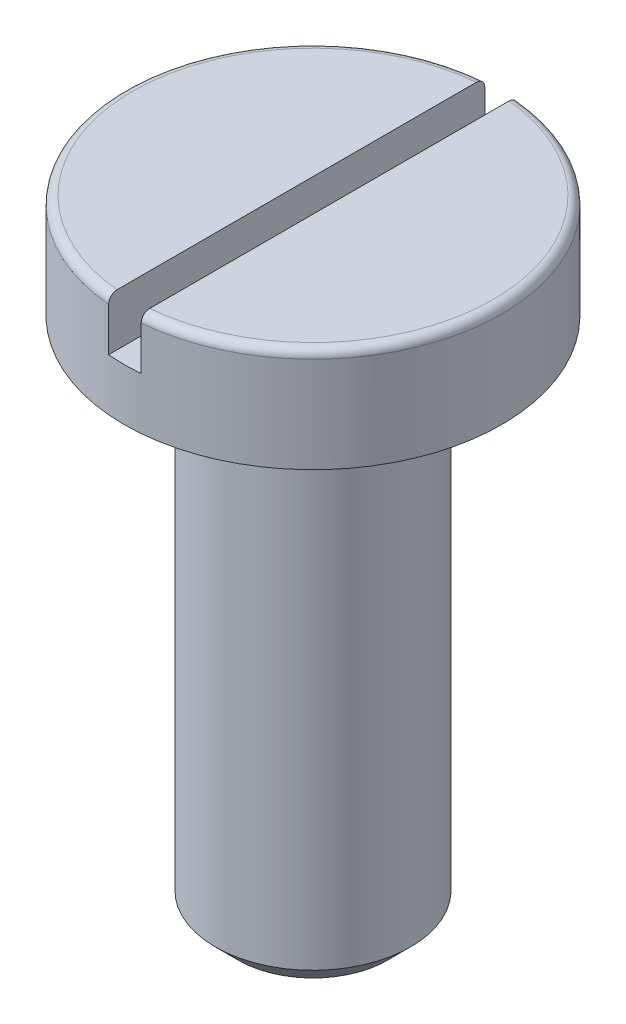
from build123d import *

# Parameters (mm, degrees)
ESQUISSE1_R             = 1.5
BASE_EXTRUSION_DEPTH    = 8
CHANFREIN1_SIZE         = 0.35
ESQUISSE3_W             = 0.5
ESQUISSE3_H             = 5.8
ENL_V_MAT_EXTRU_1_DEPTH = 0.8


with BuildPart() as part:
    # Esquisse1 → Base-Extrusion (new body)
    with BuildSketch(Plane(origin=(0, 0, 0), x_dir=(1, 0, 0), z_dir=(0, 1, 0))):
        with Locations(Location((0, 0, 0), (0, 0, 270))):
            Circle(ESQUISSE1_R)
    extrude(amount=-BASE_EXTRUSION_DEPTH)

    # Chanfrein1
    chanfrein1_edges = [part.edges().sort_by_distance(p)[0] for p in [
        (0, -8, -1.5),
    ]]
    chamfer(chanfrein1_edges, length=CHANFREIN1_SIZE)

    # Esquisse2 → Boss.-R_vol.1 (revolve)
    with BuildSketch(Plane.XY, mode=Mode.PRIVATE) as boss_r_vol_1_sk:
        with BuildLine():
            Line((0, 1.6), (0, 0))
            Line((0, 0), (2.9, 0))
            Line((2.9, 0), (2.9, 1.47))
            ThreePointArc((2.9, 1.47), (2.861923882, 1.561923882), (2.77, 1.6))
            Line((2.77, 1.6), (0, 1.6))
        make_face()
    revolve(boss_r_vol_1_sk.sketch.rotate(Axis((0, 1.3, 0), (0, -1, 0)), 90), axis=Axis((0, 1.3, 0), (0, -1, 0)))

    # Esquisse3 → Enl_v. mat.-Extru.1 (cut)
    with BuildSketch(Plane(origin=(0, 1.6, 0), x_dir=(-1, 0, 0), z_dir=(0, 1, 0))):
        Rectangle(ESQUISSE3_W, ESQUISSE3_H)
    extrude(amount=-ENL_V_MAT_EXTRU_1_DEPTH, mode=Mode.SUBTRACT)


solid = part.part
